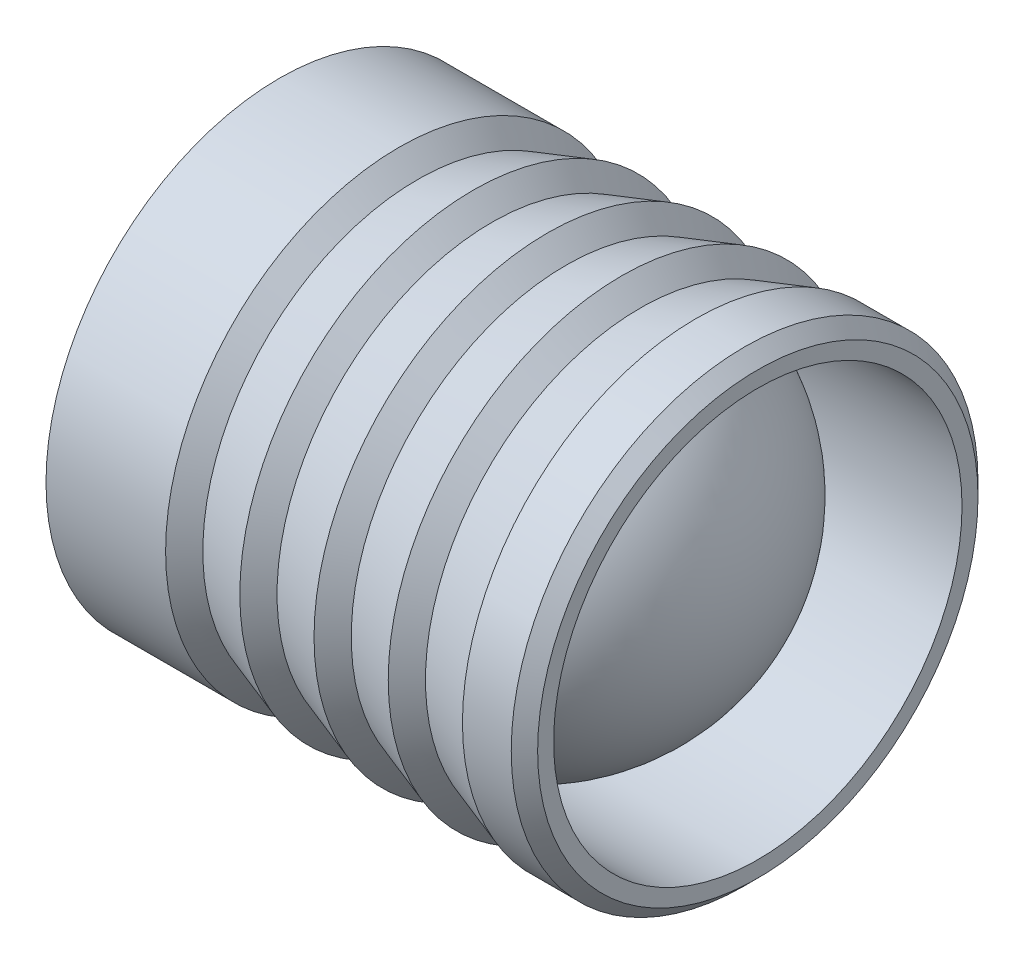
ISO-10303-21;
HEADER;
FILE_DESCRIPTION(('STEP AP214'),'2;1');
FILE_NAME('part.step','',(''),(''),'','','');
FILE_SCHEMA(('AUTOMOTIVE_DESIGN { 1 0 10303 214 1 1 1 1 }'));
ENDSEC;
DATA;
#1=APPLICATION_CONTEXT('core data for automotive mechanical design processes');
#2=APPLICATION_PROTOCOL_DEFINITION('international standard','automotive_design',2000,#1);
#3=PRODUCT_CONTEXT('',#1,'mechanical');
#4=PRODUCT('Part','Part','',(#3));
#5=PRODUCT_RELATED_PRODUCT_CATEGORY('part','',(#4));
#6=PRODUCT_DEFINITION_FORMATION('','',#4);
#7=PRODUCT_DEFINITION_CONTEXT('part definition',#1,'design');
#8=PRODUCT_DEFINITION('design','',#6,#7);
#9=PRODUCT_DEFINITION_SHAPE('','',#8);
#10=(LENGTH_UNIT() NAMED_UNIT(*) SI_UNIT(.MILLI.,.METRE.));
#11=(NAMED_UNIT(*) PLANE_ANGLE_UNIT() SI_UNIT($,.RADIAN.));
#12=(NAMED_UNIT(*) SI_UNIT($,.STERADIAN.) SOLID_ANGLE_UNIT());
#13=UNCERTAINTY_MEASURE_WITH_UNIT(LENGTH_MEASURE(1.E-05),#10,'distance_accuracy_value','');
#14=(GEOMETRIC_REPRESENTATION_CONTEXT(3) GLOBAL_UNCERTAINTY_ASSIGNED_CONTEXT((#13)) GLOBAL_UNIT_ASSIGNED_CONTEXT((#10,
#11,#12)) REPRESENTATION_CONTEXT('',''));
#15=CARTESIAN_POINT('',(0.,0.,0.));
#16=DIRECTION('',(0.,0.,1.));
#17=DIRECTION('',(1.,0.,0.));
#18=AXIS2_PLACEMENT_3D('',#15,#16,#17);
#19=CARTESIAN_POINT('',(4.69,0.,0.));
#20=DIRECTION('',(1.,0.,0.));
#21=DIRECTION('',(0.,1.,0.));
#22=AXIS2_PLACEMENT_3D('',#19,#20,#21);
#23=SPHERICAL_SURFACE('',#22,3.51);
#24=CARTESIAN_POINT('',(4.95476536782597,0.,0.));
#25=DIRECTION('',(-1.,0.,0.));
#26=DIRECTION('',(0.,0.,1.));
#27=AXIS2_PLACEMENT_3D('',#24,#25,#26);
#28=CIRCLE('',#27,3.4999999);
#29=CARTESIAN_POINT('',(4.95476536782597,0.,3.4999999));
#30=VERTEX_POINT('',#29);
#31=EDGE_CURVE('E41',#30,#30,#28,.T.);
#32=ORIENTED_EDGE('',*,*,#31,.F.);
#33=EDGE_LOOP('',(#32));
#34=FACE_BOUND('',#33,.T.);
#35=CARTESIAN_POINT('',(8.2,0.,0.));
#36=VERTEX_POINT('',#35);
#37=VERTEX_LOOP('',#36);
#38=FACE_BOUND('',#37,.T.);
#39=ADVANCED_FACE('F18',(#34,#38),#23,.T.);
#40=CARTESIAN_POINT('',(8.5,3.77372583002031,0.));
#41=DIRECTION('',(-1.,0.,0.));
#42=DIRECTION('',(0.,0.,1.));
#43=AXIS2_PLACEMENT_3D('',#40,#41,#42);
#44=PLANE('',#43);
#45=CARTESIAN_POINT('',(8.5,0.,0.));
#46=DIRECTION('',(1.,0.,0.));
#47=DIRECTION('',(0.,0.,-1.));
#48=AXIS2_PLACEMENT_3D('',#45,#46,#47);
#49=CIRCLE('',#48,3.77372583);
#50=CARTESIAN_POINT('',(8.5,0.,-3.77372583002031));
#51=VERTEX_POINT('',#50);
#52=EDGE_CURVE('E11',#51,#51,#49,.T.);
#53=ORIENTED_EDGE('',*,*,#52,.T.);
#54=EDGE_LOOP('',(#53));
#55=FACE_BOUND('',#54,.T.);
#56=CARTESIAN_POINT('',(8.5,0.,0.));
#57=DIRECTION('',(1.,0.,0.));
#58=DIRECTION('',(0.,0.,-1.));
#59=AXIS2_PLACEMENT_3D('',#56,#57,#58);
#60=CIRCLE('',#59,3.4999999);
#61=CARTESIAN_POINT('',(8.5,0.,-3.49999989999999));
#62=VERTEX_POINT('',#61);
#63=EDGE_CURVE('E29',#62,#62,#60,.T.);
#64=ORIENTED_EDGE('',*,*,#63,.F.);
#65=EDGE_LOOP('',(#64));
#66=FACE_BOUND('',#65,.T.);
#67=ADVANCED_FACE('F182',(#55,#66),#44,.F.);
#68=CARTESIAN_POINT('',(8.5,0.,0.));
#69=DIRECTION('',(-1.,0.,0.));
#70=DIRECTION('',(0.,0.,-1.));
#71=AXIS2_PLACEMENT_3D('',#68,#69,#70);
#72=CYLINDRICAL_SURFACE('',#71,3.4999999);
#73=ORIENTED_EDGE('',*,*,#63,.T.);
#74=EDGE_LOOP('',(#73));
#75=FACE_BOUND('',#74,.T.);
#76=ORIENTED_EDGE('',*,*,#31,.T.);
#77=EDGE_LOOP('',(#76));
#78=FACE_BOUND('',#77,.T.);
#79=ADVANCED_FACE('F173',(#75,#78),#72,.F.);
#80=CARTESIAN_POINT('',(0.,0.,0.));
#81=DIRECTION('',(1.,0.,0.));
#82=DIRECTION('',(0.,1.,0.));
#83=AXIS2_PLACEMENT_3D('',#80,#81,#82);
#84=PLANE('',#83);
#85=CARTESIAN_POINT('',(0.,0.,0.));
#86=DIRECTION('',(1.,0.,0.));
#87=DIRECTION('',(0.,0.,-1.));
#88=AXIS2_PLACEMENT_3D('',#85,#86,#87);
#89=CIRCLE('',#88,3.4803847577);
#90=CARTESIAN_POINT('',(0.,0.,-3.48038475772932));
#91=VERTEX_POINT('',#90);
#92=EDGE_CURVE('E127',#91,#91,#89,.T.);
#93=ORIENTED_EDGE('',*,*,#92,.F.);
#94=EDGE_LOOP('',(#93));
#95=FACE_BOUND('',#94,.T.);
#96=ADVANCED_FACE('F170',(#95),#84,.F.);
#97=CARTESIAN_POINT('',(8.27372583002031,0.,0.));
#98=DIRECTION('',(-1.,0.,0.));
#99=DIRECTION('',(0.,0.,1.));
#100=AXIS2_PLACEMENT_3D('',#97,#98,#99);
#101=CONICAL_SURFACE('',#100,4.,0.7853981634);
#102=CARTESIAN_POINT('',(8.27372583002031,0.,0.));
#103=DIRECTION('',(1.,0.,0.));
#104=DIRECTION('',(0.,0.,-1.));
#105=AXIS2_PLACEMENT_3D('',#102,#103,#104);
#106=CIRCLE('',#105,4.);
#107=CARTESIAN_POINT('',(8.27372583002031,0.,-4.));
#108=VERTEX_POINT('',#107);
#109=EDGE_CURVE('E139',#108,#108,#106,.T.);
#110=ORIENTED_EDGE('',*,*,#109,.T.);
#111=EDGE_LOOP('',(#110));
#112=FACE_BOUND('',#111,.T.);
#113=ORIENTED_EDGE('',*,*,#52,.F.);
#114=EDGE_LOOP('',(#113));
#115=FACE_BOUND('',#114,.T.);
#116=ADVANCED_FACE('F172',(#112,#115),#101,.T.);
#117=CARTESIAN_POINT('',(8.5,0.,0.));
#118=DIRECTION('',(-1.,0.,0.));
#119=DIRECTION('',(0.,0.,-1.));
#120=AXIS2_PLACEMENT_3D('',#117,#118,#119);
#121=CYLINDRICAL_SURFACE('',#120,4.);
#122=CARTESIAN_POINT('',(7.4375,0.,0.));
#123=DIRECTION('',(1.,0.,0.));
#124=DIRECTION('',(0.,0.,-1.));
#125=AXIS2_PLACEMENT_3D('',#122,#123,#124);
#126=CIRCLE('',#125,4.);
#127=CARTESIAN_POINT('',(7.4375,0.,-4.));
#128=VERTEX_POINT('',#127);
#129=EDGE_CURVE('E135',#128,#128,#126,.T.);
#130=ORIENTED_EDGE('',*,*,#129,.T.);
#131=EDGE_LOOP('',(#130));
#132=FACE_BOUND('',#131,.T.);
#133=ORIENTED_EDGE('',*,*,#109,.F.);
#134=EDGE_LOOP('',(#133));
#135=FACE_BOUND('',#134,.T.);
#136=ADVANCED_FACE('F179',(#132,#135),#121,.T.);
#137=CARTESIAN_POINT('',(6.48359375,0.,0.));
#138=DIRECTION('',(1.,0.,0.));
#139=DIRECTION('',(0.,0.,-1.));
#140=AXIS2_PLACEMENT_3D('',#137,#138,#139);
#141=CONICAL_SURFACE('',#140,3.68,0.3236657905);
#142=ORIENTED_EDGE('',*,*,#129,.F.);
#143=EDGE_LOOP('',(#142));
#144=FACE_BOUND('',#143,.T.);
#145=CARTESIAN_POINT('',(6.48359375,0.,0.));
#146=DIRECTION('',(1.,0.,0.));
#147=DIRECTION('',(0.,0.,-1.));
#148=AXIS2_PLACEMENT_3D('',#145,#146,#147);
#149=CIRCLE('',#148,3.68);
#150=CARTESIAN_POINT('',(6.48359375,0.,-3.68));
#151=VERTEX_POINT('',#150);
#152=EDGE_CURVE('E132',#151,#151,#149,.T.);
#153=ORIENTED_EDGE('',*,*,#152,.T.);
#154=EDGE_LOOP('',(#153));
#155=FACE_BOUND('',#154,.T.);
#156=ADVANCED_FACE('F198',(#144,#155),#141,.T.);
#157=CARTESIAN_POINT('',(6.165625,0.,0.));
#158=DIRECTION('',(-1.,0.,0.));
#159=DIRECTION('',(0.,0.,1.));
#160=AXIS2_PLACEMENT_3D('',#157,#158,#159);
#161=CONICAL_SURFACE('',#160,4.,0.788582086);
#162=CARTESIAN_POINT('',(6.165625,0.,0.));
#163=DIRECTION('',(1.,0.,0.));
#164=DIRECTION('',(0.,0.,-1.));
#165=AXIS2_PLACEMENT_3D('',#162,#163,#164);
#166=CIRCLE('',#165,4.);
#167=CARTESIAN_POINT('',(6.165625,0.,-4.));
#168=VERTEX_POINT('',#167);
#169=EDGE_CURVE('E66',#168,#168,#166,.T.);
#170=ORIENTED_EDGE('',*,*,#169,.T.);
#171=EDGE_LOOP('',(#170));
#172=FACE_BOUND('',#171,.T.);
#173=ORIENTED_EDGE('',*,*,#152,.F.);
#174=EDGE_LOOP('',(#173));
#175=FACE_BOUND('',#174,.T.);
#176=ADVANCED_FACE('F203',(#172,#175),#161,.T.);
#177=CARTESIAN_POINT('',(5.21171875,0.,0.));
#178=DIRECTION('',(1.,0.,0.));
#179=DIRECTION('',(0.,0.,-1.));
#180=AXIS2_PLACEMENT_3D('',#177,#178,#179);
#181=CONICAL_SURFACE('',#180,3.68,0.3236657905);
#182=ORIENTED_EDGE('',*,*,#169,.F.);
#183=EDGE_LOOP('',(#182));
#184=FACE_BOUND('',#183,.T.);
#185=CARTESIAN_POINT('',(5.21171875,0.,0.));
#186=DIRECTION('',(1.,0.,0.));
#187=DIRECTION('',(0.,0.,-1.));
#188=AXIS2_PLACEMENT_3D('',#185,#186,#187);
#189=CIRCLE('',#188,3.68);
#190=CARTESIAN_POINT('',(5.21171875,0.,-3.68));
#191=VERTEX_POINT('',#190);
#192=EDGE_CURVE('E80',#191,#191,#189,.T.);
#193=ORIENTED_EDGE('',*,*,#192,.T.);
#194=EDGE_LOOP('',(#193));
#195=FACE_BOUND('',#194,.T.);
#196=ADVANCED_FACE('F217',(#184,#195),#181,.T.);
#197=CARTESIAN_POINT('',(4.89375,0.,0.));
#198=DIRECTION('',(-1.,0.,0.));
#199=DIRECTION('',(0.,0.,1.));
#200=AXIS2_PLACEMENT_3D('',#197,#198,#199);
#201=CONICAL_SURFACE('',#200,4.,0.788582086);
#202=CARTESIAN_POINT('',(4.89375,0.,0.));
#203=DIRECTION('',(1.,0.,0.));
#204=DIRECTION('',(0.,0.,-1.));
#205=AXIS2_PLACEMENT_3D('',#202,#203,#204);
#206=CIRCLE('',#205,4.);
#207=CARTESIAN_POINT('',(4.89375,0.,-4.));
#208=VERTEX_POINT('',#207);
#209=EDGE_CURVE('E144',#208,#208,#206,.T.);
#210=ORIENTED_EDGE('',*,*,#209,.T.);
#211=EDGE_LOOP('',(#210));
#212=FACE_BOUND('',#211,.T.);
#213=ORIENTED_EDGE('',*,*,#192,.F.);
#214=EDGE_LOOP('',(#213));
#215=FACE_BOUND('',#214,.T.);
#216=ADVANCED_FACE('F219',(#212,#215),#201,.T.);
#217=CARTESIAN_POINT('',(3.93984375,0.,0.));
#218=DIRECTION('',(1.,0.,0.));
#219=DIRECTION('',(0.,0.,-1.));
#220=AXIS2_PLACEMENT_3D('',#217,#218,#219);
#221=CONICAL_SURFACE('',#220,3.68,0.3236657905);
#222=ORIENTED_EDGE('',*,*,#209,.F.);
#223=EDGE_LOOP('',(#222));
#224=FACE_BOUND('',#223,.T.);
#225=CARTESIAN_POINT('',(3.93984375,0.,0.));
#226=DIRECTION('',(1.,0.,0.));
#227=DIRECTION('',(0.,0.,-1.));
#228=AXIS2_PLACEMENT_3D('',#225,#226,#227);
#229=CIRCLE('',#228,3.68);
#230=CARTESIAN_POINT('',(3.93984375,0.,-3.68));
#231=VERTEX_POINT('',#230);
#232=EDGE_CURVE('E140',#231,#231,#229,.T.);
#233=ORIENTED_EDGE('',*,*,#232,.T.);
#234=EDGE_LOOP('',(#233));
#235=FACE_BOUND('',#234,.T.);
#236=ADVANCED_FACE('F225',(#224,#235),#221,.T.);
#237=CARTESIAN_POINT('',(3.621875,0.,0.));
#238=DIRECTION('',(-1.,0.,0.));
#239=DIRECTION('',(0.,0.,1.));
#240=AXIS2_PLACEMENT_3D('',#237,#238,#239);
#241=CONICAL_SURFACE('',#240,4.,0.788582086);
#242=CARTESIAN_POINT('',(3.621875,0.,0.));
#243=DIRECTION('',(1.,0.,0.));
#244=DIRECTION('',(0.,0.,-1.));
#245=AXIS2_PLACEMENT_3D('',#242,#243,#244);
#246=CIRCLE('',#245,4.);
#247=CARTESIAN_POINT('',(3.621875,0.,-4.));
#248=VERTEX_POINT('',#247);
#249=EDGE_CURVE('E22',#248,#248,#246,.T.);
#250=ORIENTED_EDGE('',*,*,#249,.T.);
#251=EDGE_LOOP('',(#250));
#252=FACE_BOUND('',#251,.T.);
#253=ORIENTED_EDGE('',*,*,#232,.F.);
#254=EDGE_LOOP('',(#253));
#255=FACE_BOUND('',#254,.T.);
#256=ADVANCED_FACE('F20',(#252,#255),#241,.T.);
#257=CARTESIAN_POINT('',(2.66796875,0.,0.));
#258=DIRECTION('',(1.,0.,0.));
#259=DIRECTION('',(0.,0.,-1.));
#260=AXIS2_PLACEMENT_3D('',#257,#258,#259);
#261=CONICAL_SURFACE('',#260,3.68,0.3236657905);
#262=ORIENTED_EDGE('',*,*,#249,.F.);
#263=EDGE_LOOP('',(#262));
#264=FACE_BOUND('',#263,.T.);
#265=CARTESIAN_POINT('',(2.66796875,0.,0.));
#266=DIRECTION('',(1.,0.,0.));
#267=DIRECTION('',(0.,0.,-1.));
#268=AXIS2_PLACEMENT_3D('',#265,#266,#267);
#269=CIRCLE('',#268,3.68);
#270=CARTESIAN_POINT('',(2.66796875,0.,-3.68));
#271=VERTEX_POINT('',#270);
#272=EDGE_CURVE('E116',#271,#271,#269,.T.);
#273=ORIENTED_EDGE('',*,*,#272,.T.);
#274=EDGE_LOOP('',(#273));
#275=FACE_BOUND('',#274,.T.);
#276=ADVANCED_FACE('F244',(#264,#275),#261,.T.);
#277=CARTESIAN_POINT('',(2.35,0.,0.));
#278=DIRECTION('',(-1.,0.,0.));
#279=DIRECTION('',(0.,0.,1.));
#280=AXIS2_PLACEMENT_3D('',#277,#278,#279);
#281=CONICAL_SURFACE('',#280,4.,0.788582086);
#282=CARTESIAN_POINT('',(2.35,0.,0.));
#283=DIRECTION('',(1.,0.,0.));
#284=DIRECTION('',(0.,0.,-1.));
#285=AXIS2_PLACEMENT_3D('',#282,#283,#284);
#286=CIRCLE('',#285,4.);
#287=CARTESIAN_POINT('',(2.35,0.,-4.));
#288=VERTEX_POINT('',#287);
#289=EDGE_CURVE('E112',#288,#288,#286,.T.);
#290=ORIENTED_EDGE('',*,*,#289,.T.);
#291=EDGE_LOOP('',(#290));
#292=FACE_BOUND('',#291,.T.);
#293=ORIENTED_EDGE('',*,*,#272,.F.);
#294=EDGE_LOOP('',(#293));
#295=FACE_BOUND('',#294,.T.);
#296=ADVANCED_FACE('F234',(#292,#295),#281,.T.);
#297=CARTESIAN_POINT('',(8.5,0.,0.));
#298=DIRECTION('',(-1.,0.,0.));
#299=DIRECTION('',(0.,0.,-1.));
#300=AXIS2_PLACEMENT_3D('',#297,#298,#299);
#301=CYLINDRICAL_SURFACE('',#300,4.);
#302=CARTESIAN_POINT('',(0.3,0.,0.));
#303=DIRECTION('',(1.,0.,0.));
#304=DIRECTION('',(0.,0.,-1.));
#305=AXIS2_PLACEMENT_3D('',#302,#303,#304);
#306=CIRCLE('',#305,4.);
#307=CARTESIAN_POINT('',(0.3,0.,-4.));
#308=VERTEX_POINT('',#307);
#309=EDGE_CURVE('E117',#308,#308,#306,.T.);
#310=ORIENTED_EDGE('',*,*,#309,.T.);
#311=EDGE_LOOP('',(#310));
#312=FACE_BOUND('',#311,.T.);
#313=ORIENTED_EDGE('',*,*,#289,.F.);
#314=EDGE_LOOP('',(#313));
#315=FACE_BOUND('',#314,.T.);
#316=ADVANCED_FACE('F113',(#312,#315),#301,.T.);
#317=CARTESIAN_POINT('',(0.,0.,0.));
#318=DIRECTION('',(1.,0.,0.));
#319=DIRECTION('',(0.,0.,-1.));
#320=AXIS2_PLACEMENT_3D('',#317,#318,#319);
#321=CONICAL_SURFACE('',#320,3.4803847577,1.0471975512);
#322=ORIENTED_EDGE('',*,*,#309,.F.);
#323=EDGE_LOOP('',(#322));
#324=FACE_BOUND('',#323,.T.);
#325=ORIENTED_EDGE('',*,*,#92,.T.);
#326=EDGE_LOOP('',(#325));
#327=FACE_BOUND('',#326,.T.);
#328=ADVANCED_FACE('F168',(#324,#327),#321,.T.);
#329=CLOSED_SHELL('',(#39,#67,#79,#96,#116,#136,#156,#176,#196,#216,#236,#256,#276,#296,#316,#328));
#330=CARTESIAN_POINT('',(2.44572588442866,0.,0.));
#331=DIRECTION('',(1.,0.,0.));
#332=DIRECTION('',(0.,0.,-1.));
#333=AXIS2_PLACEMENT_3D('',#330,#331,#332);
#334=CONICAL_SURFACE('',#333,3.4999999,1.0471975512);
#335=CARTESIAN_POINT('',(2.44572588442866,0.,0.));
#336=DIRECTION('',(1.,0.,0.));
#337=DIRECTION('',(0.,0.,-1.));
#338=AXIS2_PLACEMENT_3D('',#335,#336,#337);
#339=CIRCLE('',#338,3.4999999);
#340=CARTESIAN_POINT('',(2.44572588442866,0.,-3.4999999));
#341=VERTEX_POINT('',#340);
#342=EDGE_CURVE('E149',#341,#341,#339,.T.);
#343=ORIENTED_EDGE('',*,*,#342,.T.);
#344=EDGE_LOOP('',(#343));
#345=FACE_BOUND('',#344,.T.);
#346=CARTESIAN_POINT('',(0.425,0.,0.));
#347=VERTEX_POINT('',#346);
#348=VERTEX_LOOP('',#347);
#349=FACE_BOUND('',#348,.T.);
#350=ADVANCED_FACE('F239',(#345,#349),#334,.F.);
#351=CARTESIAN_POINT('',(4.69,0.,0.));
#352=DIRECTION('',(1.,0.,0.));
#353=DIRECTION('',(0.,1.,0.));
#354=AXIS2_PLACEMENT_3D('',#351,#352,#353);
#355=SPHERICAL_SURFACE('',#354,3.51);
#356=CARTESIAN_POINT('',(4.42523463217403,0.,0.));
#357=DIRECTION('',(1.,0.,0.));
#358=DIRECTION('',(0.,0.,-1.));
#359=AXIS2_PLACEMENT_3D('',#356,#357,#358);
#360=CIRCLE('',#359,3.4999999);
#361=CARTESIAN_POINT('',(4.42523463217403,0.,-3.4999999));
#362=VERTEX_POINT('',#361);
#363=EDGE_CURVE('E145',#362,#362,#360,.T.);
#364=ORIENTED_EDGE('',*,*,#363,.F.);
#365=EDGE_LOOP('',(#364));
#366=FACE_BOUND('',#365,.T.);
#367=CARTESIAN_POINT('',(1.18,0.,0.));
#368=VERTEX_POINT('',#367);
#369=VERTEX_LOOP('',#368);
#370=FACE_BOUND('',#369,.T.);
#371=ADVANCED_FACE('F242',(#366,#370),#355,.T.);
#372=CARTESIAN_POINT('',(8.5,0.,0.));
#373=DIRECTION('',(-1.,0.,0.));
#374=DIRECTION('',(0.,0.,-1.));
#375=AXIS2_PLACEMENT_3D('',#372,#373,#374);
#376=CYLINDRICAL_SURFACE('',#375,3.4999999);
#377=ORIENTED_EDGE('',*,*,#363,.T.);
#378=EDGE_LOOP('',(#377));
#379=FACE_BOUND('',#378,.T.);
#380=ORIENTED_EDGE('',*,*,#342,.F.);
#381=EDGE_LOOP('',(#380));
#382=FACE_BOUND('',#381,.T.);
#383=ADVANCED_FACE('F195',(#379,#382),#376,.F.);
#384=CLOSED_SHELL('',(#350,#371,#383));
#385=ORIENTED_CLOSED_SHELL('',*,#384,.T.);
#386=BREP_WITH_VOIDS('B1',#329,(#385));
#387=ADVANCED_BREP_SHAPE_REPRESENTATION('',(#18,#386),#14);
#388=SHAPE_DEFINITION_REPRESENTATION(#9,#387);
ENDSEC;
END-ISO-10303-21;
